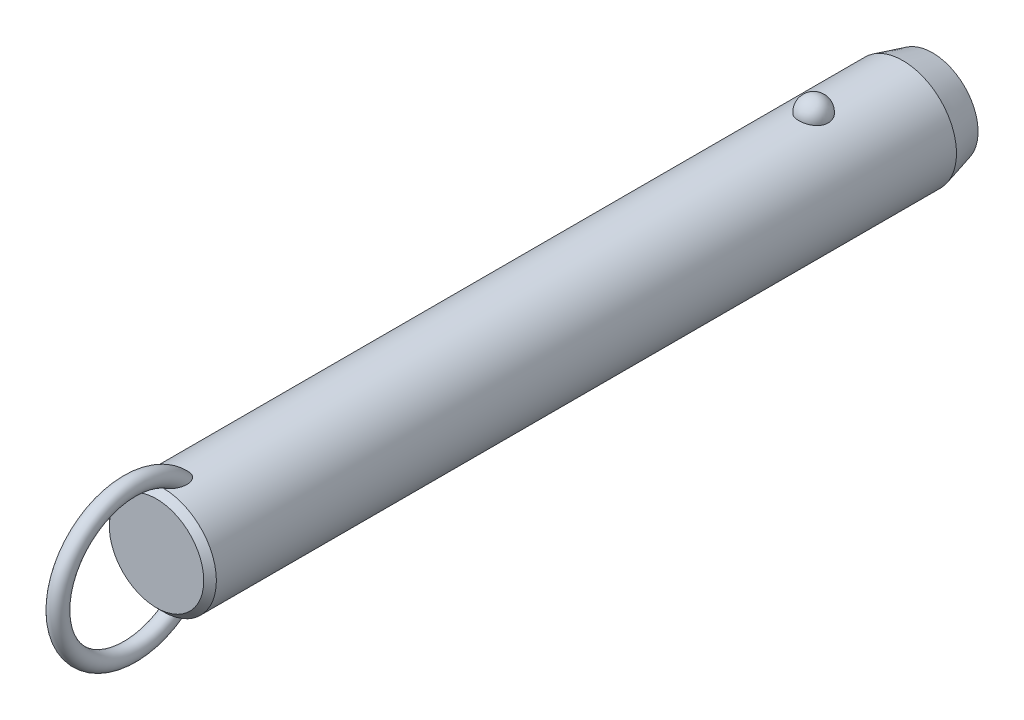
ISO-10303-21;
HEADER;
FILE_DESCRIPTION(('STEP AP214'),'2;1');
FILE_NAME('part.step','',(''),(''),'','','');
FILE_SCHEMA(('AUTOMOTIVE_DESIGN { 1 0 10303 214 1 1 1 1 }'));
ENDSEC;
DATA;
#1=APPLICATION_CONTEXT('core data for automotive mechanical design processes');
#2=APPLICATION_PROTOCOL_DEFINITION('international standard','automotive_design',2000,#1);
#3=PRODUCT_CONTEXT('',#1,'mechanical');
#4=PRODUCT('Part','Part','',(#3));
#5=PRODUCT_RELATED_PRODUCT_CATEGORY('part','',(#4));
#6=PRODUCT_DEFINITION_FORMATION('','',#4);
#7=PRODUCT_DEFINITION_CONTEXT('part definition',#1,'design');
#8=PRODUCT_DEFINITION('design','',#6,#7);
#9=PRODUCT_DEFINITION_SHAPE('','',#8);
#10=(LENGTH_UNIT() NAMED_UNIT(*) SI_UNIT(.MILLI.,.METRE.));
#11=(NAMED_UNIT(*) PLANE_ANGLE_UNIT() SI_UNIT($,.RADIAN.));
#12=(NAMED_UNIT(*) SI_UNIT($,.STERADIAN.) SOLID_ANGLE_UNIT());
#13=UNCERTAINTY_MEASURE_WITH_UNIT(LENGTH_MEASURE(1.E-05),#10,'distance_accuracy_value','');
#14=(GEOMETRIC_REPRESENTATION_CONTEXT(3) GLOBAL_UNCERTAINTY_ASSIGNED_CONTEXT((#13)) GLOBAL_UNIT_ASSIGNED_CONTEXT((#10,
#11,#12)) REPRESENTATION_CONTEXT('',''));
#15=CARTESIAN_POINT('',(0.,0.,0.));
#16=DIRECTION('',(0.,0.,1.));
#17=DIRECTION('',(1.,0.,0.));
#18=AXIS2_PLACEMENT_3D('',#15,#16,#17);
#19=CARTESIAN_POINT('',(0.,0.,139.7));
#20=DIRECTION('',(0.,0.,-1.));
#21=DIRECTION('',(-1.,0.,0.));
#22=AXIS2_PLACEMENT_3D('',#19,#20,#21);
#23=CYLINDRICAL_SURFACE('',#22,12.7);
#24=CARTESIAN_POINT('',(3.46661256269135,12.2177165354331,-3.5));
#25=CARTESIAN_POINT('',(3.4666090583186,12.2177194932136,-3.30432790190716));
#26=CARTESIAN_POINT('',(3.45063567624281,12.2222841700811,-3.10861112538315));
#27=CARTESIAN_POINT('',(3.38712451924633,12.2400345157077,-2.72271899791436));
#28=CARTESIAN_POINT('',(3.33957415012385,12.2532236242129,-2.53254588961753));
#29=CARTESIAN_POINT('',(3.2141234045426,12.286724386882,-2.16324948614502));
#30=CARTESIAN_POINT('',(3.13623639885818,12.3070329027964,-1.98412136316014));
#31=CARTESIAN_POINT('',(2.95205930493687,12.3525018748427,-1.64180592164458));
#32=CARTESIAN_POINT('',(2.84577003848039,12.3776621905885,-1.47861814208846));
#33=CARTESIAN_POINT('',(2.60688050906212,12.4301712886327,-1.17190583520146));
#34=CARTESIAN_POINT('',(2.47415697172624,12.4575299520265,-1.02847897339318));
#35=CARTESIAN_POINT('',(2.18615174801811,12.5112810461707,-0.766177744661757));
#36=CARTESIAN_POINT('',(2.03087002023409,12.5376734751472,-0.647303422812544));
#37=CARTESIAN_POINT('',(1.70237334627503,12.5864761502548,-0.437732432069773));
#38=CARTESIAN_POINT('',(1.52920948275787,12.6088972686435,-0.34695830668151));
#39=CARTESIAN_POINT('',(1.16944170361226,12.6473352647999,-0.195750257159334));
#40=CARTESIAN_POINT('',(0.982839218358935,12.663352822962,-0.135313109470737));
#41=CARTESIAN_POINT('',(0.604961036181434,12.6869706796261,-0.0473241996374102));
#42=CARTESIAN_POINT('',(0.413823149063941,12.6947125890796,-0.0192185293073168));
#43=CARTESIAN_POINT('',(0.0293827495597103,12.7014203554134,0.00517254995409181));
#44=CARTESIAN_POINT('',(-0.163919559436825,12.7003870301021,0.00146092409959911));
#45=CARTESIAN_POINT('',(-0.544374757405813,12.689735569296,-0.0373939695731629));
#46=CARTESIAN_POINT('',(-0.731575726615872,12.6802364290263,-0.0721015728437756));
#47=CARTESIAN_POINT('',(-1.09733277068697,12.6538333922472,-0.171364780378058));
#48=CARTESIAN_POINT('',(-1.27588869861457,12.6369293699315,-0.23592089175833));
#49=CARTESIAN_POINT('',(-1.6204698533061,12.5973946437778,-0.393548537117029));
#50=CARTESIAN_POINT('',(-1.78641865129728,12.5747321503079,-0.48677898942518));
#51=CARTESIAN_POINT('',(-2.10030671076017,12.5261316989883,-0.699110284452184));
#52=CARTESIAN_POINT('',(-2.24824419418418,12.5001934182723,-0.818213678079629));
#53=CARTESIAN_POINT('',(-2.52491489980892,12.4472906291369,-1.08157124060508));
#54=CARTESIAN_POINT('',(-2.65324222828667,12.4203160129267,-1.22624992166));
#55=CARTESIAN_POINT('',(-2.88410007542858,12.3687509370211,-1.53528325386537));
#56=CARTESIAN_POINT('',(-2.98662883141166,12.3441606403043,-1.69963924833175));
#57=CARTESIAN_POINT('',(-3.16432417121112,12.2998199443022,-2.04548497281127));
#58=CARTESIAN_POINT('',(-3.23917525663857,12.2801261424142,-2.22714424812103));
#59=CARTESIAN_POINT('',(-3.35800573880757,12.248167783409,-2.6009138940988));
#60=CARTESIAN_POINT('',(-3.4019860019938,12.2359030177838,-2.79302397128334));
#61=CARTESIAN_POINT('',(-3.45784812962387,12.2202347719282,-3.18140279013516));
#62=CARTESIAN_POINT('',(-3.46986123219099,12.2167950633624,-3.37765118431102));
#63=CARTESIAN_POINT('',(-3.46186273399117,12.2190638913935,-3.76943689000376));
#64=CARTESIAN_POINT('',(-3.44185196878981,12.2247721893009,-3.96497421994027));
#65=CARTESIAN_POINT('',(-3.37048652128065,12.2446381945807,-4.34881728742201));
#66=CARTESIAN_POINT('',(-3.31928253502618,12.2587552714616,-4.53715319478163));
#67=CARTESIAN_POINT('',(-3.18693461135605,12.2938237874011,-4.90231727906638));
#68=CARTESIAN_POINT('',(-3.1057895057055,12.3147754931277,-5.07914500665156));
#69=CARTESIAN_POINT('',(-2.91506431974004,12.3613125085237,-5.4173205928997));
#70=CARTESIAN_POINT('',(-2.80533587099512,12.3869217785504,-5.57858147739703));
#71=CARTESIAN_POINT('',(-2.560414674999,12.4398525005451,-5.88013283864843));
#72=CARTESIAN_POINT('',(-2.42522099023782,12.4671740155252,-6.02042254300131));
#73=CARTESIAN_POINT('',(-2.1323357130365,12.5205965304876,-6.27662798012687));
#74=CARTESIAN_POINT('',(-1.97456596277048,12.5466928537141,-6.39245542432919));
#75=CARTESIAN_POINT('',(-1.64115839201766,12.5946384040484,-6.59583547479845));
#76=CARTESIAN_POINT('',(-1.46552179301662,12.6164879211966,-6.68339001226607));
#77=CARTESIAN_POINT('',(-1.10356050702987,12.6532533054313,-6.82682153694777));
#78=CARTESIAN_POINT('',(-0.917391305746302,12.6682500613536,-6.88306988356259));
#79=CARTESIAN_POINT('',(-0.537836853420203,12.6900288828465,-6.96386887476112));
#80=CARTESIAN_POINT('',(-0.344452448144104,12.6968119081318,-6.9884232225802));
#81=CARTESIAN_POINT('',(0.0402577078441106,12.7013667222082,-7.00496469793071));
#82=CARTESIAN_POINT('',(0.231556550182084,12.6993008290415,-6.99753844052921));
#83=CARTESIAN_POINT('',(0.610105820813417,12.6867505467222,-6.95166366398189));
#84=CARTESIAN_POINT('',(0.797356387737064,12.6762664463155,-6.91321620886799));
#85=CARTESIAN_POINT('',(1.16186657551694,12.6480587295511,-6.80658431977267));
#86=CARTESIAN_POINT('',(1.33915951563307,12.6303611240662,-6.73850666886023));
#87=CARTESIAN_POINT('',(1.67968518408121,12.5896027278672,-6.57450875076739));
#88=CARTESIAN_POINT('',(1.84291705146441,12.5665416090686,-6.47858678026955));
#89=CARTESIAN_POINT('',(2.15340192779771,12.5171072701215,-6.25982455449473));
#90=CARTESIAN_POINT('',(2.30037831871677,12.4906895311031,-6.13660186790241));
#91=CARTESIAN_POINT('',(2.5717412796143,12.4376567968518,-5.86739587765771));
#92=CARTESIAN_POINT('',(2.69612388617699,12.4110417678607,-5.72140858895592));
#93=CARTESIAN_POINT('',(2.92107785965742,12.360051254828,-5.40794137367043));
#94=CARTESIAN_POINT('',(3.02121329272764,12.3357209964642,-5.24014110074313));
#95=CARTESIAN_POINT('',(3.19236291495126,12.2925446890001,-4.8896986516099));
#96=CARTESIAN_POINT('',(3.26338839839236,12.2736965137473,-4.70706226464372));
#97=CARTESIAN_POINT('',(3.36788038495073,12.245404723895,-4.35469510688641));
#98=CARTESIAN_POINT('',(3.40484026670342,12.2351018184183,-4.18605935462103));
#99=CARTESIAN_POINT('',(3.45420764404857,12.2212564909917,-3.84496058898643));
#100=CARTESIAN_POINT('',(3.46661565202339,12.2177139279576,-3.67249765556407));
#101=CARTESIAN_POINT('',(3.46661256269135,12.2177165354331,-3.5));
#102=B_SPLINE_CURVE_WITH_KNOTS('',3,(#24,#25,#26,#27,#28,#29,#30,#31,#32,#33,#34,#35,#36,#37,
#38,#39,#40,#41,#42,#43,#44,#45,#46,#47,#48,#49,#50,#51,#52,#53,#54,#55,#56,#57,#58,#59,#60,#61,
#62,#63,#64,#65,#66,#67,#68,#69,#70,#71,#72,#73,#74,#75,#76,#77,#78,#79,#80,#81,#82,#83,#84,#85,
#86,#87,#88,#89,#90,#91,#92,#93,#94,#95,#96,#97,#98,#99,#100,#101),.UNSPECIFIED.,.T.,.F.,(4,2,2,
2,2,2,2,2,2,2,2,2,2,2,2,2,2,2,2,2,2,2,2,2,2,2,2,2,2,2,2,2,2,2,2,2,2,2,4),(0.,0.586396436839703,
1.17302689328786,1.7593990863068,2.34575431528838,2.93491084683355,3.52406845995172,
4.1115873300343,4.69904375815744,5.2762784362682,5.85345931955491,6.42265312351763,
6.99185659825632,7.56427334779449,8.136746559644,8.71981013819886,9.3029135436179,
9.89247258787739,10.4820150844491,11.0691335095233,11.6562366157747,12.2405256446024,
12.8248374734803,13.412244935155,13.9996740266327,14.5891883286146,15.1786623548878,
15.7609861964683,16.3432419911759,16.914863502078,17.4864654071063,18.056024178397,
18.6256177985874,19.2037609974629,19.7820055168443,20.3699810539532,20.9577282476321,
21.4746855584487,21.9916320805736),.UNSPECIFIED.);
#103=CARTESIAN_POINT('',(3.46661256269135,12.2177165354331,-3.5));
#104=VERTEX_POINT('',#103);
#105=EDGE_CURVE('E41',#104,#104,#102,.T.);
#106=ORIENTED_EDGE('',*,*,#105,.T.);
#107=EDGE_LOOP('',(#106));
#108=FACE_BOUND('',#107,.T.);
#109=CARTESIAN_POINT('',(0.,0.,150.9));
#110=DIRECTION('',(0.,0.,1.));
#111=DIRECTION('',(1.,0.,0.));
#112=AXIS2_PLACEMENT_3D('',#109,#110,#111);
#113=CIRCLE('',#112,12.7);
#114=CARTESIAN_POINT('',(12.7,0.,150.9));
#115=VERTEX_POINT('',#114);
#116=EDGE_CURVE('E10',#115,#115,#113,.F.);
#117=ORIENTED_EDGE('',*,*,#116,.T.);
#118=EDGE_LOOP('',(#117));
#119=FACE_BOUND('',#118,.T.);
#120=CARTESIAN_POINT('',(-0.548122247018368,-12.6881662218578,144.643218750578));
#121=CARTESIAN_POINT('',(-0.648865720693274,-12.6838128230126,144.677926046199));
#122=CARTESIAN_POINT('',(-0.7463984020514,-12.6783867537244,144.722042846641));
#123=CARTESIAN_POINT('',(-0.932125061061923,-12.666091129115,144.826764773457));
#124=CARTESIAN_POINT('',(-1.02030388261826,-12.6592192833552,144.887396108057));
#125=CARTESIAN_POINT('',(-1.18487740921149,-12.6448747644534,145.021847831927));
#126=CARTESIAN_POINT('',(-1.26134296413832,-12.637406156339,145.095582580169));
#127=CARTESIAN_POINT('',(-1.40231200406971,-12.6225412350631,145.253604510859));
#128=CARTESIAN_POINT('',(-1.46681470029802,-12.6151449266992,145.33789238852));
#129=CARTESIAN_POINT('',(-1.6071478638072,-12.5981718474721,145.549657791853));
#130=CARTESIAN_POINT('',(-1.67725126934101,-12.588900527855,145.680962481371));
#131=CARTESIAN_POINT('',(-1.79536591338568,-12.5725964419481,145.953247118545));
#132=CARTESIAN_POINT('',(-1.84333535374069,-12.5655679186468,146.094244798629));
#133=CARTESIAN_POINT('',(-1.93422576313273,-12.5519624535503,146.437645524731));
#134=CARTESIAN_POINT('',(-1.96788773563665,-12.5466298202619,146.642557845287));
#135=CARTESIAN_POINT('',(-1.99413993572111,-12.542463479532,146.951760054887));
#136=CARTESIAN_POINT('',(-1.99883864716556,-12.5417153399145,147.055298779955));
#137=CARTESIAN_POINT('',(-2.00078003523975,-12.5414074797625,147.26245124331));
#138=CARTESIAN_POINT('',(-1.99802449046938,-12.5418474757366,147.366064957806));
#139=CARTESIAN_POINT('',(-1.98336733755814,-12.5441750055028,147.610320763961));
#140=CARTESIAN_POINT('',(-1.96851430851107,-12.5465291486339,147.750780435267));
#141=CARTESIAN_POINT('',(-1.92707089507,-12.5529612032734,148.029960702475));
#142=CARTESIAN_POINT('',(-1.90047458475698,-12.5570399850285,148.168680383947));
#143=CARTESIAN_POINT('',(-1.83619120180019,-12.5666008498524,148.44341135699));
#144=CARTESIAN_POINT('',(-1.79850828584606,-12.57208240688,148.579423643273));
#145=CARTESIAN_POINT('',(-1.7122379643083,-12.5841228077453,148.847842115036));
#146=CARTESIAN_POINT('',(-1.66365679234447,-12.5906810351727,148.980250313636));
#147=CARTESIAN_POINT('',(-1.5780450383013,-12.6016176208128,149.18548877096));
#148=CARTESIAN_POINT('',(-1.54477252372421,-12.6057501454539,149.259914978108));
#149=CARTESIAN_POINT('',(-1.47424480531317,-12.6141930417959,149.406839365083));
#150=CARTESIAN_POINT('',(-1.43699041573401,-12.6185033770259,149.479337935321));
#151=CARTESIAN_POINT('',(-1.35825795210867,-12.6272207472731,149.621892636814));
#152=CARTESIAN_POINT('',(-1.31678520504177,-12.6316276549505,149.691951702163));
#153=CARTESIAN_POINT('',(-1.22917793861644,-12.6404532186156,149.829070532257));
#154=CARTESIAN_POINT('',(-1.18304514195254,-12.6448718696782,149.896131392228));
#155=CARTESIAN_POINT('',(-1.07246411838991,-12.6547893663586,150.043874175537));
#156=CARTESIAN_POINT('',(-1.0064223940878,-12.6602600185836,150.123384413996));
#157=CARTESIAN_POINT('',(-0.864441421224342,-12.6707460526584,150.273169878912));
#158=CARTESIAN_POINT('',(-0.788516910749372,-12.6757620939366,150.343458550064));
#159=CARTESIAN_POINT('',(-0.652215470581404,-12.6833591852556,150.448680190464));
#160=CARTESIAN_POINT('',(-0.594982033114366,-12.6861973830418,150.487624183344));
#161=CARTESIAN_POINT('',(-0.47526962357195,-12.6912445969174,150.556489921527));
#162=CARTESIAN_POINT('',(-0.412800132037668,-12.6934547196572,150.586427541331));
#163=CARTESIAN_POINT('',(-0.29574972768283,-12.6966636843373,150.62975652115));
#164=CARTESIAN_POINT('',(-0.241949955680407,-12.6978134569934,150.645218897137));
#165=CARTESIAN_POINT('',(-0.132508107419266,-12.6994261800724,150.666884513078));
#166=CARTESIAN_POINT('',(-0.076867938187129,-12.6998898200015,150.673097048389));
#167=CARTESIAN_POINT('',(0.0347696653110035,-12.7000752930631,150.675583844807));
#168=CARTESIAN_POINT('',(0.0907676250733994,-12.6997954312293,150.671835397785));
#169=CARTESIAN_POINT('',(0.201283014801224,-12.6985255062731,150.654788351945));
#170=CARTESIAN_POINT('',(0.25579908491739,-12.6975348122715,150.641481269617));
#171=CARTESIAN_POINT('',(0.37604233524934,-12.6946091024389,150.60203792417));
#172=CARTESIAN_POINT('',(0.440950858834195,-12.6924943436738,150.573449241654));
#173=CARTESIAN_POINT('',(0.565350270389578,-12.6875639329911,150.506323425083));
#174=CARTESIAN_POINT('',(0.624828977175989,-12.6847467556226,150.467764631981));
#175=CARTESIAN_POINT('',(0.774116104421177,-12.6767252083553,150.356949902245));
#176=CARTESIAN_POINT('',(0.859449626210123,-12.6711344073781,150.278760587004));
#177=CARTESIAN_POINT('',(1.01789440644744,-12.6593922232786,150.110943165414));
#178=CARTESIAN_POINT('',(1.09096902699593,-12.653239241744,150.021282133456));
#179=CARTESIAN_POINT('',(1.22268793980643,-12.6411674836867,149.840265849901));
#180=CARTESIAN_POINT('',(1.28193986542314,-12.6352572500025,149.749345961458));
#181=CARTESIAN_POINT('',(1.39259777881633,-12.6235401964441,149.562792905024));
#182=CARTESIAN_POINT('',(1.44399707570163,-12.6177334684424,149.467155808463));
#183=CARTESIAN_POINT('',(1.53972870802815,-12.6064093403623,149.272273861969));
#184=CARTESIAN_POINT('',(1.58405262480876,-12.6008922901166,149.173024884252));
#185=CARTESIAN_POINT('',(1.66600705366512,-12.5903187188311,148.971772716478));
#186=CARTESIAN_POINT('',(1.7036365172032,-12.5852622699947,148.869769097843));
#187=CARTESIAN_POINT('',(1.77545379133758,-12.5753406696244,148.654358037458));
#188=CARTESIAN_POINT('',(1.80903453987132,-12.5705328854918,148.540745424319));
#189=CARTESIAN_POINT('',(1.86844163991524,-12.5618400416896,148.311457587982));
#190=CARTESIAN_POINT('',(1.89426665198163,-12.5579551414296,148.195782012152));
#191=CARTESIAN_POINT('',(1.9378546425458,-12.5513030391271,147.963007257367));
#192=CARTESIAN_POINT('',(1.95562640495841,-12.5485346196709,147.845909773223));
#193=CARTESIAN_POINT('',(1.98264463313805,-12.5442934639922,147.610747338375));
#194=CARTESIAN_POINT('',(1.99189298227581,-12.5428204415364,147.49268260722));
#195=CARTESIAN_POINT('',(2.00416068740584,-12.540871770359,147.180622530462));
#196=CARTESIAN_POINT('',(1.99944433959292,-12.541631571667,146.986229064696));
#197=CARTESIAN_POINT('',(1.96113755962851,-12.5476846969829,146.600309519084));
#198=CARTESIAN_POINT('',(1.92758341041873,-12.5529723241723,146.408780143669));
#199=CARTESIAN_POINT('',(1.83934342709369,-12.5661532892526,146.082272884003));
#200=CARTESIAN_POINT('',(1.79215440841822,-12.5730485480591,145.94524997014));
#201=CARTESIAN_POINT('',(1.67676242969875,-12.588958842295,145.680445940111));
#202=CARTESIAN_POINT('',(1.60859050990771,-12.597970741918,145.552651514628));
#203=CARTESIAN_POINT('',(1.46583832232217,-12.6152829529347,145.335800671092));
#204=CARTESIAN_POINT('',(1.39525727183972,-12.6233659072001,145.24410500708));
#205=CARTESIAN_POINT('',(1.23992594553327,-12.6395676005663,145.073485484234));
#206=CARTESIAN_POINT('',(1.15517932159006,-12.6476863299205,144.994558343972));
#207=CARTESIAN_POINT('',(0.971995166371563,-12.6630846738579,144.852643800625));
#208=CARTESIAN_POINT('',(0.873456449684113,-12.6703572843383,144.789784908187));
#209=CARTESIAN_POINT('',(0.665847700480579,-12.6829569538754,144.684487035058));
#210=CARTESIAN_POINT('',(0.556784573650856,-12.688285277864,144.642034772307));
#211=CARTESIAN_POINT('',(0.347338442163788,-12.6956226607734,144.584443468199));
#212=CARTESIAN_POINT('',(0.247759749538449,-12.6979816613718,144.566399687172));
#213=CARTESIAN_POINT('',(0.0470218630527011,-12.7003077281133,144.548600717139));
#214=CARTESIAN_POINT('',(-0.0541350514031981,-12.7002779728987,144.548821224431));
#215=CARTESIAN_POINT('',(-0.221414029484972,-12.6982482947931,144.564363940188));
#216=CARTESIAN_POINT('',(-0.288055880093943,-12.6969033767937,144.574666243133));
#217=CARTESIAN_POINT('',(-0.419599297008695,-12.6932369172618,144.60313489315));
#218=CARTESIAN_POINT('',(-0.484501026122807,-12.6909154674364,144.621300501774));
#219=CARTESIAN_POINT('',(-0.548122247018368,-12.6881662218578,144.643218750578));
#220=B_SPLINE_CURVE_WITH_KNOTS('',3,(#120,#121,#122,#123,#124,#125,#126,#127,#128,#129,#130,
#131,#132,#133,#134,#135,#136,#137,#138,#139,#140,#141,#142,#143,#144,#145,#146,#147,#148,#149,
#150,#151,#152,#153,#154,#155,#156,#157,#158,#159,#160,#161,#162,#163,#164,#165,#166,#167,#168,
#169,#170,#171,#172,#173,#174,#175,#176,#177,#178,#179,#180,#181,#182,#183,#184,#185,#186,#187,
#188,#189,#190,#191,#192,#193,#194,#195,#196,#197,#198,#199,#200,#201,#202,#203,#204,#205,#206,
#207,#208,#209,#210,#211,#212,#213,#214,#215,#216,#217,#218,#219),.UNSPECIFIED.,.T.,.F.,(4,2,2,
2,2,2,2,2,2,2,2,2,2,2,2,2,2,2,2,2,2,2,2,2,2,2,2,2,2,2,2,2,2,2,2,2,2,2,2,2,2,2,2,2,2,2,2,2,2,4),
(0.,0.319642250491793,0.639794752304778,0.95792700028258,1.27608021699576,1.72100165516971,
2.16675988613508,2.78630021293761,3.09705782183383,3.4077412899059,3.83096358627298,
4.25439969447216,4.67767724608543,5.10071330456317,5.34550297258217,5.59024267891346,
5.83467707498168,6.07902143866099,6.38891080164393,6.69834321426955,6.90560910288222,
7.11250749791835,7.27977315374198,7.44687060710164,7.61434932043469,7.78197685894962,
7.99365544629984,8.20579780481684,8.55147335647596,8.89816429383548,9.22375138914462,
9.54961437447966,9.87586224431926,10.2021611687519,10.557587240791,10.9130746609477,
11.2681734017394,11.6231936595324,12.2046601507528,12.7853961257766,13.219164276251,
13.6522938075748,13.9989174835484,14.3454519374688,14.6946768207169,15.0436740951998,
15.3457513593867,15.6474266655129,15.8493051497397,16.0511646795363),.UNSPECIFIED.);
#221=CARTESIAN_POINT('',(-0.548122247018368,-12.6881662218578,144.643218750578));
#222=VERTEX_POINT('',#221);
#223=EDGE_CURVE('E59',#222,#222,#220,.T.);
#224=ORIENTED_EDGE('',*,*,#223,.T.);
#225=EDGE_LOOP('',(#224));
#226=FACE_BOUND('',#225,.T.);
#227=CARTESIAN_POINT('',(-0.548122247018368,12.6881662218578,144.643218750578));
#228=CARTESIAN_POINT('',(-0.459436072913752,12.6919968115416,144.612673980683));
#229=CARTESIAN_POINT('',(-0.368189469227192,12.6949996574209,144.589391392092));
#230=CARTESIAN_POINT('',(-0.183024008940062,12.6990186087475,144.558406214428));
#231=CARTESIAN_POINT('',(-0.0891049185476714,12.7000345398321,144.550704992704));
#232=CARTESIAN_POINT('',(0.0987147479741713,12.6999636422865,144.551245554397));
#233=CARTESIAN_POINT('',(0.192615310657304,12.6988761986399,144.559492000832));
#234=CARTESIAN_POINT('',(0.377658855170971,12.6947211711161,144.591551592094));
#235=CARTESIAN_POINT('',(0.468801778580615,12.6916535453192,144.615365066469));
#236=CARTESIAN_POINT('',(0.645809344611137,12.6838788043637,144.67745651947));
#237=CARTESIAN_POINT('',(0.731679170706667,12.6791733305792,144.715720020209));
#238=CARTESIAN_POINT('',(0.896315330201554,12.6686004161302,144.805120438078));
#239=CARTESIAN_POINT('',(0.975080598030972,12.6627328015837,144.856259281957));
#240=CARTESIAN_POINT('',(1.12963655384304,12.6499161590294,144.97367820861));
#241=CARTESIAN_POINT('',(1.20478673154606,12.6429194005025,145.040792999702));
#242=CARTESIAN_POINT('',(1.34448241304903,12.6288282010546,145.18522507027));
#243=CARTESIAN_POINT('',(1.40902173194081,12.621733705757,145.262548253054));
#244=CARTESIAN_POINT('',(1.55208211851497,12.6050877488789,145.459247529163));
#245=CARTESIAN_POINT('',(1.62510490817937,12.5957546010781,145.582654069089));
#246=CARTESIAN_POINT('',(1.7501904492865,12.5789823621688,145.839769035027));
#247=CARTESIAN_POINT('',(1.80221377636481,12.5715468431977,145.973496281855));
#248=CARTESIAN_POINT('',(1.90309965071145,12.5567434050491,146.298351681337));
#249=CARTESIAN_POINT('',(1.94342317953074,12.5504515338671,146.492161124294));
#250=CARTESIAN_POINT('',(1.99332997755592,12.5426147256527,146.88378810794));
#251=CARTESIAN_POINT('',(2.00285305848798,12.5410790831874,147.081612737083));
#252=CARTESIAN_POINT('',(1.99678999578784,12.5420407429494,147.416642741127));
#253=CARTESIAN_POINT('',(1.98794117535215,12.5434564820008,147.554042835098));
#254=CARTESIAN_POINT('',(1.95865119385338,12.5480641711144,147.827639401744));
#255=CARTESIAN_POINT('',(1.93820436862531,12.5512569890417,147.963835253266));
#256=CARTESIAN_POINT('',(1.886478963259,12.5591352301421,148.234249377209));
#257=CARTESIAN_POINT('',(1.85518800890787,12.5638223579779,148.368465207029));
#258=CARTESIAN_POINT('',(1.782178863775,12.5743868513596,148.633936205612));
#259=CARTESIAN_POINT('',(1.74046509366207,12.5802637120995,148.765192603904));
#260=CARTESIAN_POINT('',(1.66024095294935,12.5910571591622,148.986085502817));
#261=CARTESIAN_POINT('',(1.62434772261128,12.5957535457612,149.076690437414));
#262=CARTESIAN_POINT('',(1.54709009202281,12.6054762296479,149.255512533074));
#263=CARTESIAN_POINT('',(1.50572681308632,12.6105024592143,149.343730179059));
#264=CARTESIAN_POINT('',(1.41728020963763,12.620748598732,149.516932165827));
#265=CARTESIAN_POINT('',(1.37021377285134,12.625967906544,149.601925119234));
#266=CARTESIAN_POINT('',(1.26969620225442,12.6364721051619,149.768007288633));
#267=CARTESIAN_POINT('',(1.21624929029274,12.6417569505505,149.849099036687));
#268=CARTESIAN_POINT('',(1.10304413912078,12.6521331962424,150.004702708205));
#269=CARTESIAN_POINT('',(1.04340936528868,12.657226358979,150.079303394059));
#270=CARTESIAN_POINT('',(0.915919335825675,12.6670906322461,150.221324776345));
#271=CARTESIAN_POINT('',(0.848064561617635,12.6718617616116,150.28874589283));
#272=CARTESIAN_POINT('',(0.717035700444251,12.67987711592,150.400624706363));
#273=CARTESIAN_POINT('',(0.655526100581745,12.6832377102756,150.446997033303));
#274=CARTESIAN_POINT('',(0.525985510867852,12.6892676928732,150.529619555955));
#275=CARTESIAN_POINT('',(0.457969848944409,12.6919386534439,150.565892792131));
#276=CARTESIAN_POINT('',(0.334859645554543,12.695691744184,150.616657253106));
#277=CARTESIAN_POINT('',(0.281116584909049,12.6970073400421,150.634373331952));
#278=CARTESIAN_POINT('',(0.171425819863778,12.6989609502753,150.660642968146));
#279=CARTESIAN_POINT('',(0.11548082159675,12.699599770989,150.669207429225));
#280=CARTESIAN_POINT('',(0.00272618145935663,12.7001251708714,150.676253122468));
#281=CARTESIAN_POINT('',(-0.0540859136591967,12.7000089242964,150.674696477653));
#282=CARTESIAN_POINT('',(-0.166544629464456,12.6990328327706,150.661600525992));
#283=CARTESIAN_POINT('',(-0.222190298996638,12.6981724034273,150.650053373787));
#284=CARTESIAN_POINT('',(-0.342018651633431,12.695562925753,150.614912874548));
#285=CARTESIAN_POINT('',(-0.405606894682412,12.6936676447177,150.58933225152));
#286=CARTESIAN_POINT('',(-0.52781549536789,12.6891754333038,150.528311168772));
#287=CARTESIAN_POINT('',(-0.586425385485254,12.6865770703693,150.492850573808));
#288=CARTESIAN_POINT('',(-0.731842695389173,12.6792129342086,150.391496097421));
#289=CARTESIAN_POINT('',(-0.814709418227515,12.6740767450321,150.3200395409));
#290=CARTESIAN_POINT('',(-0.969101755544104,12.6632083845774,150.16589007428));
#291=CARTESIAN_POINT('',(-1.04059564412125,12.6574746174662,150.083166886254));
#292=CARTESIAN_POINT('',(-1.1698111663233,12.6461638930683,149.915809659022));
#293=CARTESIAN_POINT('',(-1.2281136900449,12.6405994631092,149.831616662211));
#294=CARTESIAN_POINT('',(-1.33743405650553,12.6295007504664,149.658579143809));
#295=CARTESIAN_POINT('',(-1.38844577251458,12.6239664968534,149.569730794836));
#296=CARTESIAN_POINT('',(-1.48400702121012,12.6130898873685,149.388389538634));
#297=CARTESIAN_POINT('',(-1.5285423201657,12.6077479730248,149.295889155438));
#298=CARTESIAN_POINT('',(-1.61150113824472,12.5974127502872,149.108160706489));
#299=CARTESIAN_POINT('',(-1.64992317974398,12.5924195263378,149.012931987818));
#300=CARTESIAN_POINT('',(-1.73468589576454,12.581070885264,148.78289362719));
#301=CARTESIAN_POINT('',(-1.77831261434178,12.5749388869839,148.647066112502));
#302=CARTESIAN_POINT('',(-1.85439734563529,12.5639437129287,148.372212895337));
#303=CARTESIAN_POINT('',(-1.88684994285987,12.5590811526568,148.233185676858));
#304=CARTESIAN_POINT('',(-1.9400848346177,12.550968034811,147.95309235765));
#305=CARTESIAN_POINT('',(-1.96088706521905,12.5477147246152,147.812030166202));
#306=CARTESIAN_POINT('',(-1.99000539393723,12.5431291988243,147.528668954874));
#307=CARTESIAN_POINT('',(-1.99832911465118,12.5417958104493,147.386370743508));
#308=CARTESIAN_POINT('',(-2.00166624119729,12.5412674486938,147.057627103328));
#309=CARTESIAN_POINT('',(-1.99178843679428,12.5428579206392,146.871088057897));
#310=CARTESIAN_POINT('',(-1.9445518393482,12.5502731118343,146.50162404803));
#311=CARTESIAN_POINT('',(-1.90724032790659,12.5560905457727,146.318693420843));
#312=CARTESIAN_POINT('',(-1.81330718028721,12.5699462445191,146.004848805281));
#313=CARTESIAN_POINT('',(-1.76338820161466,12.5771273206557,145.871910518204));
#314=CARTESIAN_POINT('',(-1.6430501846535,12.593414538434,145.615681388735));
#315=CARTESIAN_POINT('',(-1.57265346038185,12.6025185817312,145.492380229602));
#316=CARTESIAN_POINT('',(-1.42634956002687,12.6198178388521,145.283564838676));
#317=CARTESIAN_POINT('',(-1.35423772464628,12.6278405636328,145.195384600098));
#318=CARTESIAN_POINT('',(-1.19645664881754,12.6437632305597,145.032107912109));
#319=CARTESIAN_POINT('',(-1.11080536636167,12.6516633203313,144.956994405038));
#320=CARTESIAN_POINT('',(-0.947219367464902,12.6648319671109,144.837811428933));
#321=CARTESIAN_POINT('',(-0.871624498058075,12.670300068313,144.790541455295));
#322=CARTESIAN_POINT('',(-0.714161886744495,12.6801492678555,144.7077413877));
#323=CARTESIAN_POINT('',(-0.632295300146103,12.684530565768,144.67220913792));
#324=CARTESIAN_POINT('',(-0.548122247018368,12.6881662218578,144.643218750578));
#325=B_SPLINE_CURVE_WITH_KNOTS('',3,(#227,#228,#229,#230,#231,#232,#233,#234,#235,#236,#237,
#238,#239,#240,#241,#242,#243,#244,#245,#246,#247,#248,#249,#250,#251,#252,#253,#254,#255,#256,
#257,#258,#259,#260,#261,#262,#263,#264,#265,#266,#267,#268,#269,#270,#271,#272,#273,#274,#275,
#276,#277,#278,#279,#280,#281,#282,#283,#284,#285,#286,#287,#288,#289,#290,#291,#292,#293,#294,
#295,#296,#297,#298,#299,#300,#301,#302,#303,#304,#305,#306,#307,#308,#309,#310,#311,#312,#313,
#314,#315,#316,#317,#318,#319,#320,#321,#322,#323,#324),.UNSPECIFIED.,.T.,.F.,(4,2,2,2,2,2,2,2,
2,2,2,2,2,2,2,2,2,2,2,2,2,2,2,2,2,2,2,2,2,2,2,2,2,2,2,2,2,2,2,2,2,2,2,2,2,2,2,2,4),(0.,
0.281328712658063,0.562682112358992,0.844117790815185,1.12555942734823,1.40671982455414,
1.68792232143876,1.98972294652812,2.29169886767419,2.72039860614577,3.14989948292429,
3.74084916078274,4.33295293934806,4.74554109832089,5.15833092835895,5.57159335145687,
5.98468079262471,6.27722775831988,6.56971484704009,6.86135609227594,7.15280542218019,
7.43927407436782,7.72572595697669,7.95635862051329,8.18646071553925,8.35559393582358,
8.52452541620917,8.69408946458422,8.86378678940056,9.06834348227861,9.27332014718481,
9.60010414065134,9.92778432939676,10.2350252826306,10.5425229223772,10.8506864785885,
11.1589244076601,11.5867893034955,12.0148612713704,12.4421984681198,12.8692745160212,
13.4279365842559,13.9856380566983,14.4107062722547,14.8353130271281,15.1765567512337,
15.5173516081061,15.7844129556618,16.051425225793),.UNSPECIFIED.);
#326=CARTESIAN_POINT('',(-0.548122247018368,12.6881662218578,144.643218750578));
#327=VERTEX_POINT('',#326);
#328=EDGE_CURVE('E67',#327,#327,#325,.T.);
#329=ORIENTED_EDGE('',*,*,#328,.T.);
#330=EDGE_LOOP('',(#329));
#331=FACE_BOUND('',#330,.T.);
#332=CARTESIAN_POINT('',(0.,0.,-24.6999999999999));
#333=DIRECTION('',(0.,0.,-1.));
#334=DIRECTION('',(-1.,0.,0.));
#335=AXIS2_PLACEMENT_3D('',#332,#333,#334);
#336=CIRCLE('',#335,12.7);
#337=CARTESIAN_POINT('',(-12.7,0.,-24.6999999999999));
#338=VERTEX_POINT('',#337);
#339=EDGE_CURVE('E56',#338,#338,#336,.F.);
#340=ORIENTED_EDGE('',*,*,#339,.T.);
#341=EDGE_LOOP('',(#340));
#342=FACE_BOUND('',#341,.T.);
#343=ADVANCED_FACE('F37',(#108,#119,#226,#331,#342),#23,.T.);
#344=CARTESIAN_POINT('',(0.,0.,-31.7));
#345=DIRECTION('',(0.,0.,-1.));
#346=DIRECTION('',(-1.,0.,0.));
#347=AXIS2_PLACEMENT_3D('',#344,#345,#346);
#348=PLANE('',#347);
#349=CARTESIAN_POINT('',(0.,0.,-31.7));
#350=DIRECTION('',(0.,0.,-1.));
#351=DIRECTION('',(-1.,0.,0.));
#352=AXIS2_PLACEMENT_3D('',#349,#350,#351);
#353=CIRCLE('',#352,10.8243556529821);
#354=CARTESIAN_POINT('',(-10.8243556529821,0.,-31.7));
#355=VERTEX_POINT('',#354);
#356=EDGE_CURVE('E66',#355,#355,#353,.T.);
#357=ORIENTED_EDGE('',*,*,#356,.T.);
#358=EDGE_LOOP('',(#357));
#359=FACE_BOUND('',#358,.T.);
#360=ADVANCED_FACE('F85',(#359),#348,.T.);
#361=CARTESIAN_POINT('',(0.,0.,-31.7));
#362=DIRECTION('',(0.,0.,1.));
#363=DIRECTION('',(1.,0.,0.));
#364=AXIS2_PLACEMENT_3D('',#361,#362,#363);
#365=CONICAL_SURFACE('',#364,10.8243556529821,0.261799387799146);
#366=ORIENTED_EDGE('',*,*,#339,.F.);
#367=EDGE_LOOP('',(#366));
#368=FACE_BOUND('',#367,.T.);
#369=ORIENTED_EDGE('',*,*,#356,.F.);
#370=EDGE_LOOP('',(#369));
#371=FACE_BOUND('',#370,.T.);
#372=ADVANCED_FACE('F83',(#368,#371),#365,.T.);
#373=CARTESIAN_POINT('',(0.,0.,152.4));
#374=DIRECTION('',(0.,0.,1.));
#375=DIRECTION('',(1.,0.,0.));
#376=AXIS2_PLACEMENT_3D('',#373,#374,#375);
#377=PLANE('',#376);
#378=CARTESIAN_POINT('',(0.,0.,152.4));
#379=DIRECTION('',(0.,0.,1.));
#380=DIRECTION('',(1.,0.,0.));
#381=AXIS2_PLACEMENT_3D('',#378,#379,#380);
#382=CIRCLE('',#381,11.2);
#383=CARTESIAN_POINT('',(11.2,0.,152.4));
#384=VERTEX_POINT('',#383);
#385=EDGE_CURVE('E50',#384,#384,#382,.T.);
#386=ORIENTED_EDGE('',*,*,#385,.T.);
#387=EDGE_LOOP('',(#386));
#388=FACE_BOUND('',#387,.T.);
#389=ADVANCED_FACE('F77',(#388),#377,.T.);
#390=CARTESIAN_POINT('',(0.,0.,158.75));
#391=DIRECTION('',(1.,0.,0.));
#392=DIRECTION('',(0.,0.,-1.));
#393=AXIS2_PLACEMENT_3D('',#390,#391,#392);
#394=TOROIDAL_SURFACE('',#393,17.05,2.);
#395=ORIENTED_EDGE('',*,*,#328,.F.);
#396=EDGE_LOOP('',(#395));
#397=FACE_BOUND('',#396,.T.);
#398=ORIENTED_EDGE('',*,*,#223,.F.);
#399=EDGE_LOOP('',(#398));
#400=FACE_BOUND('',#399,.T.);
#401=ADVANCED_FACE('F73',(#397,#400),#394,.T.);
#402=CARTESIAN_POINT('',(0.,0.,152.4));
#403=DIRECTION('',(0.,0.,-1.));
#404=DIRECTION('',(-1.,0.,0.));
#405=AXIS2_PLACEMENT_3D('',#402,#403,#404);
#406=CONICAL_SURFACE('',#405,11.2,0.785398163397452);
#407=ORIENTED_EDGE('',*,*,#116,.F.);
#408=EDGE_LOOP('',(#407));
#409=FACE_BOUND('',#408,.T.);
#410=ORIENTED_EDGE('',*,*,#385,.F.);
#411=EDGE_LOOP('',(#410));
#412=FACE_BOUND('',#411,.T.);
#413=ADVANCED_FACE('F39',(#409,#412),#406,.T.);
#414=CARTESIAN_POINT('',(0.,12.7,-3.5));
#415=DIRECTION('',(0.,1.,0.));
#416=DIRECTION('',(0.,0.,1.));
#417=AXIS2_PLACEMENT_3D('',#414,#415,#416);
#418=SPHERICAL_SURFACE('',#417,3.5);
#419=ORIENTED_EDGE('',*,*,#105,.F.);
#420=EDGE_LOOP('',(#419));
#421=FACE_BOUND('',#420,.T.);
#422=ADVANCED_FACE('F79',(#421),#418,.T.);
#423=CLOSED_SHELL('',(#343,#360,#372,#389,#401,#413,#422));
#424=MANIFOLD_SOLID_BREP('B2',#423);
#425=ADVANCED_BREP_SHAPE_REPRESENTATION('',(#18,#424),#14);
#426=SHAPE_DEFINITION_REPRESENTATION(#9,#425);
ENDSEC;
END-ISO-10303-21;
